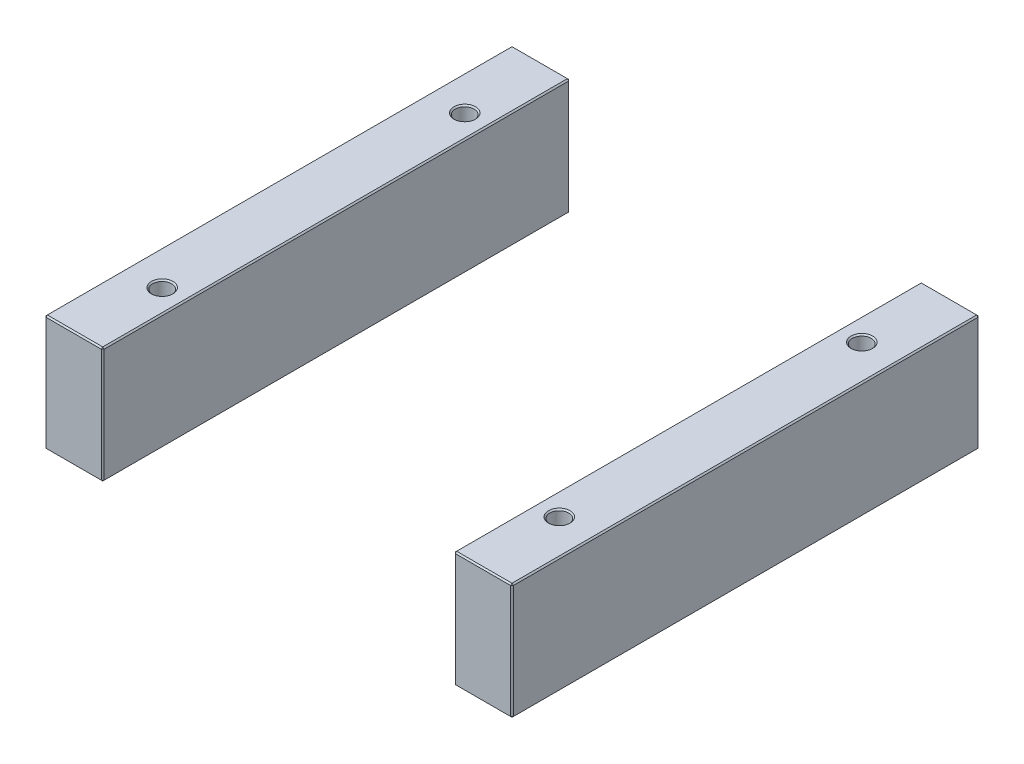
ISO-10303-21;
HEADER;
FILE_DESCRIPTION(('STEP AP214'),'2;1');
FILE_NAME('part.step','',(''),(''),'','','');
FILE_SCHEMA(('AUTOMOTIVE_DESIGN { 1 0 10303 214 1 1 1 1 }'));
ENDSEC;
DATA;
#1=APPLICATION_CONTEXT('core data for automotive mechanical design processes');
#2=APPLICATION_PROTOCOL_DEFINITION('international standard','automotive_design',2000,#1);
#3=PRODUCT_CONTEXT('',#1,'mechanical');
#4=PRODUCT('Part','Part','',(#3));
#5=PRODUCT_RELATED_PRODUCT_CATEGORY('part','',(#4));
#6=PRODUCT_DEFINITION_FORMATION('','',#4);
#7=PRODUCT_DEFINITION_CONTEXT('part definition',#1,'design');
#8=PRODUCT_DEFINITION('design','',#6,#7);
#9=PRODUCT_DEFINITION_SHAPE('','',#8);
#10=(LENGTH_UNIT() NAMED_UNIT(*) SI_UNIT(.MILLI.,.METRE.));
#11=(NAMED_UNIT(*) PLANE_ANGLE_UNIT() SI_UNIT($,.RADIAN.));
#12=(NAMED_UNIT(*) SI_UNIT($,.STERADIAN.) SOLID_ANGLE_UNIT());
#13=UNCERTAINTY_MEASURE_WITH_UNIT(LENGTH_MEASURE(1.E-05),#10,'distance_accuracy_value','');
#14=(GEOMETRIC_REPRESENTATION_CONTEXT(3) GLOBAL_UNCERTAINTY_ASSIGNED_CONTEXT((#13)) GLOBAL_UNIT_ASSIGNED_CONTEXT((#10,
#11,#12)) REPRESENTATION_CONTEXT('',''));
#15=CARTESIAN_POINT('',(0.,0.,0.));
#16=DIRECTION('',(0.,0.,1.));
#17=DIRECTION('',(1.,0.,0.));
#18=AXIS2_PLACEMENT_3D('',#15,#16,#17);
#19=CARTESIAN_POINT('',(-173.,86.,-173.));
#20=DIRECTION('',(0.,0.,1.));
#21=DIRECTION('',(1.,0.,0.));
#22=AXIS2_PLACEMENT_3D('',#19,#20,#21);
#23=PLANE('',#22);
#24=DIRECTION('',(-1.,0.,0.));
#25=VECTOR('',#24,1.);
#26=CARTESIAN_POINT('',(-173.,0.999999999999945,-173.));
#27=LINE('',#26,#25);
#28=CARTESIAN_POINT('',(-131.,0.999999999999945,-173.));
#29=VERTEX_POINT('',#28);
#30=CARTESIAN_POINT('',(-172.,0.999999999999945,-173.));
#31=VERTEX_POINT('',#30);
#32=EDGE_CURVE('P0_E137',#29,#31,#27,.T.);
#33=ORIENTED_EDGE('',*,*,#32,.T.);
#34=DIRECTION('',(0.,1.,0.));
#35=VECTOR('',#34,1.);
#36=CARTESIAN_POINT('',(-172.,86.,-173.));
#37=LINE('',#36,#35);
#38=CARTESIAN_POINT('',(-172.,85.,-173.));
#39=VERTEX_POINT('',#38);
#40=EDGE_CURVE('P0_E235',#31,#39,#37,.T.);
#41=ORIENTED_EDGE('',*,*,#40,.T.);
#42=DIRECTION('',(1.,0.,0.));
#43=VECTOR('',#42,1.);
#44=CARTESIAN_POINT('',(-173.,85.,-173.));
#45=LINE('',#44,#43);
#46=CARTESIAN_POINT('',(-131.,85.,-173.));
#47=VERTEX_POINT('',#46);
#48=EDGE_CURVE('P0_E233',#39,#47,#45,.T.);
#49=ORIENTED_EDGE('',*,*,#48,.T.);
#50=DIRECTION('',(0.,-1.,0.));
#51=VECTOR('',#50,1.);
#52=CARTESIAN_POINT('',(-131.,86.,-173.));
#53=LINE('',#52,#51);
#54=EDGE_CURVE('P0_E230',#47,#29,#53,.T.);
#55=ORIENTED_EDGE('',*,*,#54,.T.);
#56=EDGE_LOOP('',(#33,#41,#49,#55));
#57=FACE_BOUND('',#56,.T.);
#58=ADVANCED_FACE('P0_F16',(#57),#23,.F.);
#59=CARTESIAN_POINT('',(-173.,86.,173.));
#60=DIRECTION('',(1.,0.,0.));
#61=DIRECTION('',(0.,0.,-1.));
#62=AXIS2_PLACEMENT_3D('',#59,#60,#61);
#63=PLANE('',#62);
#64=DIRECTION('',(0.,1.,0.));
#65=VECTOR('',#64,1.);
#66=CARTESIAN_POINT('',(-173.,86.,172.));
#67=LINE('',#66,#65);
#68=CARTESIAN_POINT('',(-173.,0.999999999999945,172.));
#69=VERTEX_POINT('',#68);
#70=CARTESIAN_POINT('',(-173.,85.,172.));
#71=VERTEX_POINT('',#70);
#72=EDGE_CURVE('P0_E217',#69,#71,#67,.T.);
#73=ORIENTED_EDGE('',*,*,#72,.T.);
#74=DIRECTION('',(0.,0.,-1.));
#75=VECTOR('',#74,1.);
#76=CARTESIAN_POINT('',(-173.,85.,173.));
#77=LINE('',#76,#75);
#78=CARTESIAN_POINT('',(-173.,85.,-172.));
#79=VERTEX_POINT('',#78);
#80=EDGE_CURVE('P0_E228',#71,#79,#77,.T.);
#81=ORIENTED_EDGE('',*,*,#80,.T.);
#82=DIRECTION('',(0.,-1.,0.));
#83=VECTOR('',#82,1.);
#84=CARTESIAN_POINT('',(-173.,86.,-172.));
#85=LINE('',#84,#83);
#86=CARTESIAN_POINT('',(-173.,0.999999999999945,-172.));
#87=VERTEX_POINT('',#86);
#88=EDGE_CURVE('P0_E225',#79,#87,#85,.T.);
#89=ORIENTED_EDGE('',*,*,#88,.T.);
#90=DIRECTION('',(0.,0.,1.));
#91=VECTOR('',#90,1.);
#92=CARTESIAN_POINT('',(-173.,0.999999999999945,173.));
#93=LINE('',#92,#91);
#94=EDGE_CURVE('P0_E214',#87,#69,#93,.T.);
#95=ORIENTED_EDGE('',*,*,#94,.T.);
#96=EDGE_LOOP('',(#73,#81,#89,#95));
#97=FACE_BOUND('',#96,.T.);
#98=ADVANCED_FACE('P0_F302',(#97),#63,.F.);
#99=CARTESIAN_POINT('',(-173.,86.,173.));
#100=DIRECTION('',(0.,0.,-1.));
#101=DIRECTION('',(-1.,0.,0.));
#102=AXIS2_PLACEMENT_3D('',#99,#100,#101);
#103=PLANE('',#102);
#104=DIRECTION('',(-1.,0.,0.));
#105=VECTOR('',#104,1.);
#106=CARTESIAN_POINT('',(-173.,85.,173.));
#107=LINE('',#106,#105);
#108=CARTESIAN_POINT('',(-131.,85.,173.));
#109=VERTEX_POINT('',#108);
#110=CARTESIAN_POINT('',(-172.,85.,173.));
#111=VERTEX_POINT('',#110);
#112=EDGE_CURVE('P0_E242',#109,#111,#107,.T.);
#113=ORIENTED_EDGE('',*,*,#112,.T.);
#114=DIRECTION('',(0.,-1.,0.));
#115=VECTOR('',#114,1.);
#116=CARTESIAN_POINT('',(-172.,86.,173.));
#117=LINE('',#116,#115);
#118=CARTESIAN_POINT('',(-172.,0.999999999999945,173.));
#119=VERTEX_POINT('',#118);
#120=EDGE_CURVE('P0_E244',#111,#119,#117,.T.);
#121=ORIENTED_EDGE('',*,*,#120,.T.);
#122=DIRECTION('',(1.,0.,0.));
#123=VECTOR('',#122,1.);
#124=CARTESIAN_POINT('',(-130.,0.999999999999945,173.));
#125=LINE('',#124,#123);
#126=CARTESIAN_POINT('',(-131.,0.999999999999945,173.));
#127=VERTEX_POINT('',#126);
#128=EDGE_CURVE('P0_E240',#119,#127,#125,.T.);
#129=ORIENTED_EDGE('',*,*,#128,.T.);
#130=DIRECTION('',(0.,1.,0.));
#131=VECTOR('',#130,1.);
#132=CARTESIAN_POINT('',(-131.,86.,173.));
#133=LINE('',#132,#131);
#134=EDGE_CURVE('P0_E238',#127,#109,#133,.T.);
#135=ORIENTED_EDGE('',*,*,#134,.T.);
#136=EDGE_LOOP('',(#113,#121,#129,#135));
#137=FACE_BOUND('',#136,.T.);
#138=ADVANCED_FACE('P0_F341',(#137),#103,.F.);
#139=CARTESIAN_POINT('',(-130.,86.,-173.));
#140=DIRECTION('',(-1.,0.,0.));
#141=DIRECTION('',(0.,0.,1.));
#142=AXIS2_PLACEMENT_3D('',#139,#140,#141);
#143=PLANE('',#142);
#144=DIRECTION('',(0.,0.,1.));
#145=VECTOR('',#144,1.);
#146=CARTESIAN_POINT('',(-130.,85.,-173.));
#147=LINE('',#146,#145);
#148=CARTESIAN_POINT('',(-130.,85.,-172.));
#149=VERTEX_POINT('',#148);
#150=CARTESIAN_POINT('',(-130.,85.,172.));
#151=VERTEX_POINT('',#150);
#152=EDGE_CURVE('P0_E31',#149,#151,#147,.T.);
#153=ORIENTED_EDGE('',*,*,#152,.T.);
#154=DIRECTION('',(0.,-1.,0.));
#155=VECTOR('',#154,1.);
#156=CARTESIAN_POINT('',(-130.,86.,172.));
#157=LINE('',#156,#155);
#158=CARTESIAN_POINT('',(-130.,0.999999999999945,172.));
#159=VERTEX_POINT('',#158);
#160=EDGE_CURVE('P0_E190',#151,#159,#157,.T.);
#161=ORIENTED_EDGE('',*,*,#160,.T.);
#162=DIRECTION('',(0.,0.,-1.));
#163=VECTOR('',#162,1.);
#164=CARTESIAN_POINT('',(-130.,0.999999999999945,-173.));
#165=LINE('',#164,#163);
#166=CARTESIAN_POINT('',(-130.,0.999999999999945,-172.));
#167=VERTEX_POINT('',#166);
#168=EDGE_CURVE('P0_E256',#159,#167,#165,.T.);
#169=ORIENTED_EDGE('',*,*,#168,.T.);
#170=DIRECTION('',(0.,1.,0.));
#171=VECTOR('',#170,1.);
#172=CARTESIAN_POINT('',(-130.,86.,-172.));
#173=LINE('',#172,#171);
#174=EDGE_CURVE('P0_E36',#167,#149,#173,.T.);
#175=ORIENTED_EDGE('',*,*,#174,.T.);
#176=EDGE_LOOP('',(#153,#161,#169,#175));
#177=FACE_BOUND('',#176,.T.);
#178=ADVANCED_FACE('P0_F535',(#177),#143,.F.);
#179=CARTESIAN_POINT('',(0.,86.,0.));
#180=DIRECTION('',(0.,-1.,0.));
#181=DIRECTION('',(0.,0.,-1.));
#182=AXIS2_PLACEMENT_3D('',#179,#180,#181);
#183=PLANE('',#182);
#184=CARTESIAN_POINT('',(-147.,86.,112.));
#185=DIRECTION('',(0.,-1.,0.));
#186=DIRECTION('',(0.,0.,-1.));
#187=AXIS2_PLACEMENT_3D('',#184,#185,#186);
#188=CIRCLE('',#187,8.);
#189=CARTESIAN_POINT('',(-147.,86.,104.));
#190=VERTEX_POINT('',#189);
#191=EDGE_CURVE('P0_E24',#190,#190,#188,.T.);
#192=ORIENTED_EDGE('',*,*,#191,.T.);
#193=EDGE_LOOP('',(#192));
#194=FACE_BOUND('',#193,.T.);
#195=CARTESIAN_POINT('',(-147.,86.,-112.));
#196=DIRECTION('',(0.,-1.,0.));
#197=DIRECTION('',(0.,0.,-1.));
#198=AXIS2_PLACEMENT_3D('',#195,#196,#197);
#199=CIRCLE('',#198,8.);
#200=CARTESIAN_POINT('',(-147.,86.,-120.));
#201=VERTEX_POINT('',#200);
#202=EDGE_CURVE('P0_E189',#201,#201,#199,.T.);
#203=ORIENTED_EDGE('',*,*,#202,.T.);
#204=EDGE_LOOP('',(#203));
#205=FACE_BOUND('',#204,.T.);
#206=DIRECTION('',(0.,0.,1.));
#207=VECTOR('',#206,1.);
#208=CARTESIAN_POINT('',(-172.,86.,0.));
#209=LINE('',#208,#207);
#210=CARTESIAN_POINT('',(-172.,86.,-172.));
#211=VERTEX_POINT('',#210);
#212=CARTESIAN_POINT('',(-172.,86.,172.));
#213=VERTEX_POINT('',#212);
#214=EDGE_CURVE('P0_E251',#211,#213,#209,.T.);
#215=ORIENTED_EDGE('',*,*,#214,.T.);
#216=DIRECTION('',(1.,0.,0.));
#217=VECTOR('',#216,1.);
#218=CARTESIAN_POINT('',(1.11022302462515E-13,86.,172.));
#219=LINE('',#218,#217);
#220=CARTESIAN_POINT('',(-131.,86.,172.));
#221=VERTEX_POINT('',#220);
#222=EDGE_CURVE('P0_E253',#213,#221,#219,.T.);
#223=ORIENTED_EDGE('',*,*,#222,.T.);
#224=DIRECTION('',(0.,0.,-1.));
#225=VECTOR('',#224,1.);
#226=CARTESIAN_POINT('',(-131.,86.,0.));
#227=LINE('',#226,#225);
#228=CARTESIAN_POINT('',(-131.,86.,-172.));
#229=VERTEX_POINT('',#228);
#230=EDGE_CURVE('P0_E247',#221,#229,#227,.T.);
#231=ORIENTED_EDGE('',*,*,#230,.T.);
#232=DIRECTION('',(-1.,0.,0.));
#233=VECTOR('',#232,1.);
#234=CARTESIAN_POINT('',(-1.11022302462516E-13,86.,-172.));
#235=LINE('',#234,#233);
#236=EDGE_CURVE('P0_E249',#229,#211,#235,.T.);
#237=ORIENTED_EDGE('',*,*,#236,.T.);
#238=EDGE_LOOP('',(#215,#223,#231,#237));
#239=FACE_BOUND('',#238,.T.);
#240=ADVANCED_FACE('P0_F195',(#194,#205,#239),#183,.F.);
#241=CARTESIAN_POINT('',(0.,0.,0.));
#242=DIRECTION('',(0.,-1.,0.));
#243=DIRECTION('',(0.,0.,-1.));
#244=AXIS2_PLACEMENT_3D('',#241,#242,#243);
#245=PLANE('',#244);
#246=CARTESIAN_POINT('',(-147.,0.,-112.));
#247=DIRECTION('',(0.,-1.,0.));
#248=DIRECTION('',(0.,0.,-1.));
#249=AXIS2_PLACEMENT_3D('',#246,#247,#248);
#250=CIRCLE('',#249,8.);
#251=CARTESIAN_POINT('',(-147.,0.,-120.));
#252=VERTEX_POINT('',#251);
#253=EDGE_CURVE('P0_E220',#252,#252,#250,.F.);
#254=ORIENTED_EDGE('',*,*,#253,.T.);
#255=EDGE_LOOP('',(#254));
#256=FACE_BOUND('',#255,.T.);
#257=CARTESIAN_POINT('',(-147.,0.,112.));
#258=DIRECTION('',(0.,-1.,0.));
#259=DIRECTION('',(0.,0.,-1.));
#260=AXIS2_PLACEMENT_3D('',#257,#258,#259);
#261=CIRCLE('',#260,8.);
#262=CARTESIAN_POINT('',(-147.,0.,104.));
#263=VERTEX_POINT('',#262);
#264=EDGE_CURVE('P0_E608',#263,#263,#261,.F.);
#265=ORIENTED_EDGE('',*,*,#264,.T.);
#266=EDGE_LOOP('',(#265));
#267=FACE_BOUND('',#266,.T.);
#268=DIRECTION('',(-1.,0.,0.));
#269=VECTOR('',#268,1.);
#270=CARTESIAN_POINT('',(-173.,0.,172.));
#271=LINE('',#270,#269);
#272=CARTESIAN_POINT('',(-131.,0.,172.));
#273=VERTEX_POINT('',#272);
#274=CARTESIAN_POINT('',(-172.,0.,172.));
#275=VERTEX_POINT('',#274);
#276=EDGE_CURVE('P0_E114',#273,#275,#271,.T.);
#277=ORIENTED_EDGE('',*,*,#276,.T.);
#278=DIRECTION('',(0.,0.,-1.));
#279=VECTOR('',#278,1.);
#280=CARTESIAN_POINT('',(-172.,0.,-173.));
#281=LINE('',#280,#279);
#282=CARTESIAN_POINT('',(-172.,0.,-172.));
#283=VERTEX_POINT('',#282);
#284=EDGE_CURVE('P0_E110',#275,#283,#281,.T.);
#285=ORIENTED_EDGE('',*,*,#284,.T.);
#286=DIRECTION('',(1.,0.,0.));
#287=VECTOR('',#286,1.);
#288=CARTESIAN_POINT('',(-130.,0.,-172.));
#289=LINE('',#288,#287);
#290=CARTESIAN_POINT('',(-131.,0.,-172.));
#291=VERTEX_POINT('',#290);
#292=EDGE_CURVE('P0_E104',#283,#291,#289,.T.);
#293=ORIENTED_EDGE('',*,*,#292,.T.);
#294=DIRECTION('',(0.,0.,1.));
#295=VECTOR('',#294,1.);
#296=CARTESIAN_POINT('',(-131.,0.,173.));
#297=LINE('',#296,#295);
#298=EDGE_CURVE('P0_E107',#291,#273,#297,.T.);
#299=ORIENTED_EDGE('',*,*,#298,.T.);
#300=EDGE_LOOP('',(#277,#285,#293,#299));
#301=FACE_BOUND('',#300,.T.);
#302=ADVANCED_FACE('P0_F106',(#256,#267,#301),#245,.T.);
#303=CARTESIAN_POINT('',(-147.,0.,-112.));
#304=DIRECTION('',(0.,1.,0.));
#305=DIRECTION('',(0.,0.,1.));
#306=AXIS2_PLACEMENT_3D('',#303,#304,#305);
#307=CYLINDRICAL_SURFACE('',#306,7.);
#308=CARTESIAN_POINT('',(-147.,85.,-112.));
#309=DIRECTION('',(0.,-1.,0.));
#310=DIRECTION('',(0.,0.,-1.));
#311=AXIS2_PLACEMENT_3D('',#308,#309,#310);
#312=CIRCLE('',#311,7.);
#313=CARTESIAN_POINT('',(-147.,85.,-119.));
#314=VERTEX_POINT('',#313);
#315=EDGE_CURVE('P0_E10',#314,#314,#312,.F.);
#316=ORIENTED_EDGE('',*,*,#315,.T.);
#317=EDGE_LOOP('',(#316));
#318=FACE_BOUND('',#317,.T.);
#319=CARTESIAN_POINT('',(-147.,1.00000000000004,-112.));
#320=DIRECTION('',(0.,-1.,0.));
#321=DIRECTION('',(0.,0.,-1.));
#322=AXIS2_PLACEMENT_3D('',#319,#320,#321);
#323=CIRCLE('',#322,7.);
#324=CARTESIAN_POINT('',(-147.,1.00000000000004,-119.));
#325=VERTEX_POINT('',#324);
#326=EDGE_CURVE('P0_E215',#325,#325,#323,.T.);
#327=ORIENTED_EDGE('',*,*,#326,.T.);
#328=EDGE_LOOP('',(#327));
#329=FACE_BOUND('',#328,.T.);
#330=ADVANCED_FACE('P0_F208',(#318,#329),#307,.F.);
#331=CARTESIAN_POINT('',(-147.,0.,112.));
#332=DIRECTION('',(0.,1.,0.));
#333=DIRECTION('',(0.,0.,1.));
#334=AXIS2_PLACEMENT_3D('',#331,#332,#333);
#335=CYLINDRICAL_SURFACE('',#334,7.);
#336=CARTESIAN_POINT('',(-147.,85.,112.));
#337=DIRECTION('',(0.,-1.,0.));
#338=DIRECTION('',(0.,0.,-1.));
#339=AXIS2_PLACEMENT_3D('',#336,#337,#338);
#340=CIRCLE('',#339,7.);
#341=CARTESIAN_POINT('',(-147.,85.,105.));
#342=VERTEX_POINT('',#341);
#343=EDGE_CURVE('P0_E186',#342,#342,#340,.F.);
#344=ORIENTED_EDGE('',*,*,#343,.T.);
#345=EDGE_LOOP('',(#344));
#346=FACE_BOUND('',#345,.T.);
#347=CARTESIAN_POINT('',(-147.,1.00000000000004,112.));
#348=DIRECTION('',(0.,-1.,0.));
#349=DIRECTION('',(0.,0.,-1.));
#350=AXIS2_PLACEMENT_3D('',#347,#348,#349);
#351=CIRCLE('',#350,7.);
#352=CARTESIAN_POINT('',(-147.,1.00000000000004,105.));
#353=VERTEX_POINT('',#352);
#354=EDGE_CURVE('P0_E212',#353,#353,#351,.T.);
#355=ORIENTED_EDGE('',*,*,#354,.T.);
#356=EDGE_LOOP('',(#355));
#357=FACE_BOUND('',#356,.T.);
#358=ADVANCED_FACE('P0_F204',(#346,#357),#335,.F.);
#359=CARTESIAN_POINT('',(-147.,0.,-112.));
#360=DIRECTION('',(0.,-1.,0.));
#361=DIRECTION('',(0.,0.,-1.));
#362=AXIS2_PLACEMENT_3D('',#359,#360,#361);
#363=CONICAL_SURFACE('',#362,8.,0.78539816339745);
#364=ORIENTED_EDGE('',*,*,#326,.F.);
#365=EDGE_LOOP('',(#364));
#366=FACE_BOUND('',#365,.T.);
#367=ORIENTED_EDGE('',*,*,#253,.F.);
#368=EDGE_LOOP('',(#367));
#369=FACE_BOUND('',#368,.T.);
#370=ADVANCED_FACE('P0_F207',(#366,#369),#363,.F.);
#371=CARTESIAN_POINT('',(-147.,0.,112.));
#372=DIRECTION('',(0.,-1.,0.));
#373=DIRECTION('',(0.,0.,-1.));
#374=AXIS2_PLACEMENT_3D('',#371,#372,#373);
#375=CONICAL_SURFACE('',#374,8.,0.78539816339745);
#376=ORIENTED_EDGE('',*,*,#354,.F.);
#377=EDGE_LOOP('',(#376));
#378=FACE_BOUND('',#377,.T.);
#379=ORIENTED_EDGE('',*,*,#264,.F.);
#380=EDGE_LOOP('',(#379));
#381=FACE_BOUND('',#380,.T.);
#382=ADVANCED_FACE('P0_F347',(#378,#381),#375,.F.);
#383=CARTESIAN_POINT('',(-130.,86.,172.));
#384=DIRECTION('',(-0.707106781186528,0.,-0.707106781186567));
#385=DIRECTION('',(0.,-1.,0.));
#386=AXIS2_PLACEMENT_3D('',#383,#384,#385);
#387=PLANE('',#386);
#388=DIRECTION('',(-0.707106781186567,0.,0.707106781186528));
#389=VECTOR('',#388,1.);
#390=CARTESIAN_POINT('',(-130.5,85.,172.5));
#391=LINE('',#390,#389);
#392=EDGE_CURVE('P0_E125',#109,#151,#391,.F.);
#393=ORIENTED_EDGE('',*,*,#392,.F.);
#394=ORIENTED_EDGE('',*,*,#134,.F.);
#395=DIRECTION('',(0.707106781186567,0.,-0.707106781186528));
#396=VECTOR('',#395,1.);
#397=CARTESIAN_POINT('',(-131.,0.999999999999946,173.));
#398=LINE('',#397,#396);
#399=EDGE_CURVE('P0_E181',#159,#127,#398,.F.);
#400=ORIENTED_EDGE('',*,*,#399,.F.);
#401=ORIENTED_EDGE('',*,*,#160,.F.);
#402=EDGE_LOOP('',(#393,#394,#400,#401));
#403=FACE_BOUND('',#402,.T.);
#404=ADVANCED_FACE('P0_F351',(#403),#387,.F.);
#405=CARTESIAN_POINT('',(-131.,86.,172.));
#406=DIRECTION('',(0.577350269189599,0.577350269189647,0.577350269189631));
#407=DIRECTION('',(0.,-0.707106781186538,0.707106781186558));
#408=AXIS2_PLACEMENT_3D('',#405,#406,#407);
#409=PLANE('',#408);
#410=DIRECTION('',(0.,0.707106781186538,-0.707106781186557));
#411=VECTOR('',#410,1.);
#412=CARTESIAN_POINT('',(-131.,86.,172.));
#413=LINE('',#412,#411);
#414=EDGE_CURVE('P0_E175',#109,#221,#413,.T.);
#415=ORIENTED_EDGE('',*,*,#414,.F.);
#416=ORIENTED_EDGE('',*,*,#392,.T.);
#417=DIRECTION('',(0.707106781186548,-0.707106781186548,0.));
#418=VECTOR('',#417,1.);
#419=CARTESIAN_POINT('',(-131.,86.,172.));
#420=LINE('',#419,#418);
#421=EDGE_CURVE('P0_E178',#221,#151,#420,.T.);
#422=ORIENTED_EDGE('',*,*,#421,.F.);
#423=EDGE_LOOP('',(#415,#416,#422));
#424=FACE_BOUND('',#423,.T.);
#425=ADVANCED_FACE('P0_F487',(#424),#409,.T.);
#426=CARTESIAN_POINT('',(-131.,0.999999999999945,173.));
#427=DIRECTION('',(0.577350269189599,-0.577350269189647,0.577350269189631));
#428=DIRECTION('',(0.,-0.707106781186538,-0.707106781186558));
#429=AXIS2_PLACEMENT_3D('',#426,#427,#428);
#430=PLANE('',#429);
#431=DIRECTION('',(0.707106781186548,0.707106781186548,0.));
#432=VECTOR('',#431,1.);
#433=CARTESIAN_POINT('',(-130.5,0.500000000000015,172.));
#434=LINE('',#433,#432);
#435=EDGE_CURVE('P0_E123',#159,#273,#434,.F.);
#436=ORIENTED_EDGE('',*,*,#435,.F.);
#437=ORIENTED_EDGE('',*,*,#399,.T.);
#438=DIRECTION('',(0.,-0.707106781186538,-0.707106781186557));
#439=VECTOR('',#438,1.);
#440=CARTESIAN_POINT('',(-131.,0.999999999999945,173.));
#441=LINE('',#440,#439);
#442=EDGE_CURVE('P0_E172',#273,#127,#441,.F.);
#443=ORIENTED_EDGE('',*,*,#442,.F.);
#444=EDGE_LOOP('',(#436,#437,#443));
#445=FACE_BOUND('',#444,.T.);
#446=ADVANCED_FACE('P0_F478',(#445),#430,.T.);
#447=CARTESIAN_POINT('',(-131.,86.,0.));
#448=DIRECTION('',(-0.707106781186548,-0.707106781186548,0.));
#449=DIRECTION('',(0.,0.,-1.));
#450=AXIS2_PLACEMENT_3D('',#447,#448,#449);
#451=PLANE('',#450);
#452=ORIENTED_EDGE('',*,*,#421,.T.);
#453=ORIENTED_EDGE('',*,*,#152,.F.);
#454=DIRECTION('',(-0.707106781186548,0.707106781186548,0.));
#455=VECTOR('',#454,1.);
#456=CARTESIAN_POINT('',(-130.5,85.5,-172.));
#457=LINE('',#456,#455);
#458=EDGE_CURVE('P0_E165',#229,#149,#457,.F.);
#459=ORIENTED_EDGE('',*,*,#458,.F.);
#460=ORIENTED_EDGE('',*,*,#230,.F.);
#461=EDGE_LOOP('',(#452,#453,#459,#460));
#462=FACE_BOUND('',#461,.T.);
#463=ADVANCED_FACE('P0_F318',(#462),#451,.F.);
#464=CARTESIAN_POINT('',(1.11022302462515E-13,86.,172.));
#465=DIRECTION('',(0.,-0.707106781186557,-0.707106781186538));
#466=DIRECTION('',(1.,0.,0.));
#467=AXIS2_PLACEMENT_3D('',#464,#465,#466);
#468=PLANE('',#467);
#469=ORIENTED_EDGE('',*,*,#414,.T.);
#470=ORIENTED_EDGE('',*,*,#222,.F.);
#471=DIRECTION('',(0.,-0.707106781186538,0.707106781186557));
#472=VECTOR('',#471,1.);
#473=CARTESIAN_POINT('',(-172.,85.5,172.5));
#474=LINE('',#473,#472);
#475=EDGE_CURVE('P0_E162',#111,#213,#474,.F.);
#476=ORIENTED_EDGE('',*,*,#475,.F.);
#477=ORIENTED_EDGE('',*,*,#112,.F.);
#478=EDGE_LOOP('',(#469,#470,#476,#477));
#479=FACE_BOUND('',#478,.T.);
#480=ADVANCED_FACE('P0_F313',(#479),#468,.F.);
#481=CARTESIAN_POINT('',(-172.,86.,173.));
#482=DIRECTION('',(0.707106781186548,0.,-0.707106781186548));
#483=DIRECTION('',(0.,-1.,0.));
#484=AXIS2_PLACEMENT_3D('',#481,#482,#483);
#485=PLANE('',#484);
#486=DIRECTION('',(0.707106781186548,0.,0.707106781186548));
#487=VECTOR('',#486,1.);
#488=CARTESIAN_POINT('',(-172.,0.999999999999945,173.));
#489=LINE('',#488,#487);
#490=EDGE_CURVE('P0_E156',#119,#69,#489,.F.);
#491=ORIENTED_EDGE('',*,*,#490,.F.);
#492=ORIENTED_EDGE('',*,*,#120,.F.);
#493=DIRECTION('',(-0.707106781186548,0.,-0.707106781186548));
#494=VECTOR('',#493,1.);
#495=CARTESIAN_POINT('',(-173.,85.,172.));
#496=LINE('',#495,#494);
#497=EDGE_CURVE('P0_E159',#71,#111,#496,.F.);
#498=ORIENTED_EDGE('',*,*,#497,.F.);
#499=ORIENTED_EDGE('',*,*,#72,.F.);
#500=EDGE_LOOP('',(#491,#492,#498,#499));
#501=FACE_BOUND('',#500,.T.);
#502=ADVANCED_FACE('P0_F307',(#501),#485,.F.);
#503=CARTESIAN_POINT('',(-173.,0.999999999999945,173.));
#504=DIRECTION('',(0.,-0.707106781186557,0.707106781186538));
#505=DIRECTION('',(-1.,0.,0.));
#506=AXIS2_PLACEMENT_3D('',#503,#504,#505);
#507=PLANE('',#506);
#508=ORIENTED_EDGE('',*,*,#442,.T.);
#509=ORIENTED_EDGE('',*,*,#128,.F.);
#510=DIRECTION('',(0.,0.707106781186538,0.707106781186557));
#511=VECTOR('',#510,1.);
#512=CARTESIAN_POINT('',(-172.,0.999999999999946,173.));
#513=LINE('',#512,#511);
#514=EDGE_CURVE('P0_E134',#275,#119,#513,.T.);
#515=ORIENTED_EDGE('',*,*,#514,.F.);
#516=ORIENTED_EDGE('',*,*,#276,.F.);
#517=EDGE_LOOP('',(#508,#509,#515,#516));
#518=FACE_BOUND('',#517,.T.);
#519=ADVANCED_FACE('P0_F333',(#518),#507,.T.);
#520=CARTESIAN_POINT('',(-130.,0.999999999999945,-173.));
#521=DIRECTION('',(0.707106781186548,-0.707106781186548,0.));
#522=DIRECTION('',(0.,0.,1.));
#523=AXIS2_PLACEMENT_3D('',#520,#521,#522);
#524=PLANE('',#523);
#525=ORIENTED_EDGE('',*,*,#435,.T.);
#526=ORIENTED_EDGE('',*,*,#298,.F.);
#527=DIRECTION('',(-0.707106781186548,-0.707106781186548,0.));
#528=VECTOR('',#527,1.);
#529=CARTESIAN_POINT('',(-131.,0.,-172.));
#530=LINE('',#529,#528);
#531=EDGE_CURVE('P0_E120',#167,#291,#530,.T.);
#532=ORIENTED_EDGE('',*,*,#531,.F.);
#533=ORIENTED_EDGE('',*,*,#168,.F.);
#534=EDGE_LOOP('',(#525,#526,#532,#533));
#535=FACE_BOUND('',#534,.T.);
#536=ADVANCED_FACE('P0_F119',(#535),#524,.T.);
#537=CARTESIAN_POINT('',(-131.,86.,-173.));
#538=DIRECTION('',(-0.707106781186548,0.,0.707106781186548));
#539=DIRECTION('',(0.,-1.,0.));
#540=AXIS2_PLACEMENT_3D('',#537,#538,#539);
#541=PLANE('',#540);
#542=DIRECTION('',(0.707106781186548,0.,0.707106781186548));
#543=VECTOR('',#542,1.);
#544=CARTESIAN_POINT('',(-131.,85.,-173.));
#545=LINE('',#544,#543);
#546=EDGE_CURVE('P0_E168',#149,#47,#545,.F.);
#547=ORIENTED_EDGE('',*,*,#546,.F.);
#548=ORIENTED_EDGE('',*,*,#174,.F.);
#549=DIRECTION('',(-0.707106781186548,0.,-0.707106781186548));
#550=VECTOR('',#549,1.);
#551=CARTESIAN_POINT('',(-130.5,0.999999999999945,-172.5));
#552=LINE('',#551,#550);
#553=EDGE_CURVE('P0_E133',#29,#167,#552,.F.);
#554=ORIENTED_EDGE('',*,*,#553,.F.);
#555=ORIENTED_EDGE('',*,*,#54,.F.);
#556=EDGE_LOOP('',(#547,#548,#554,#555));
#557=FACE_BOUND('',#556,.T.);
#558=ADVANCED_FACE('P0_F323',(#557),#541,.F.);
#559=CARTESIAN_POINT('',(-131.,85.,-173.));
#560=DIRECTION('',(0.57735026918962,0.577350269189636,-0.57735026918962));
#561=DIRECTION('',(0.,0.707106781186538,0.707106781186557));
#562=AXIS2_PLACEMENT_3D('',#559,#560,#561);
#563=PLANE('',#562);
#564=ORIENTED_EDGE('',*,*,#458,.T.);
#565=ORIENTED_EDGE('',*,*,#546,.T.);
#566=DIRECTION('',(0.,-0.707106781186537,-0.707106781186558));
#567=VECTOR('',#566,1.);
#568=CARTESIAN_POINT('',(-131.,85.,-173.));
#569=LINE('',#568,#567);
#570=EDGE_CURVE('P0_E151',#229,#47,#569,.T.);
#571=ORIENTED_EDGE('',*,*,#570,.F.);
#572=EDGE_LOOP('',(#564,#565,#571));
#573=FACE_BOUND('',#572,.T.);
#574=ADVANCED_FACE('P0_F321',(#573),#563,.T.);
#575=CARTESIAN_POINT('',(-173.,85.,172.));
#576=DIRECTION('',(-0.57735026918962,0.577350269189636,0.57735026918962));
#577=DIRECTION('',(0.,-0.707106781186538,0.707106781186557));
#578=AXIS2_PLACEMENT_3D('',#575,#576,#577);
#579=PLANE('',#578);
#580=ORIENTED_EDGE('',*,*,#497,.T.);
#581=ORIENTED_EDGE('',*,*,#475,.T.);
#582=DIRECTION('',(0.707106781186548,0.707106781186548,0.));
#583=VECTOR('',#582,1.);
#584=CARTESIAN_POINT('',(-173.,85.,172.));
#585=LINE('',#584,#583);
#586=EDGE_CURVE('P0_E142',#71,#213,#585,.T.);
#587=ORIENTED_EDGE('',*,*,#586,.F.);
#588=EDGE_LOOP('',(#580,#581,#587));
#589=FACE_BOUND('',#588,.T.);
#590=ADVANCED_FACE('P0_F310',(#589),#579,.T.);
#591=CARTESIAN_POINT('',(-172.,0.999999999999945,173.));
#592=DIRECTION('',(-0.57735026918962,-0.577350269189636,0.57735026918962));
#593=DIRECTION('',(0.,-0.707106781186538,-0.707106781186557));
#594=AXIS2_PLACEMENT_3D('',#591,#592,#593);
#595=PLANE('',#594);
#596=ORIENTED_EDGE('',*,*,#514,.T.);
#597=ORIENTED_EDGE('',*,*,#490,.T.);
#598=DIRECTION('',(0.707106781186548,-0.707106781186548,0.));
#599=VECTOR('',#598,1.);
#600=CARTESIAN_POINT('',(-172.5,0.499999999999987,172.));
#601=LINE('',#600,#599);
#602=EDGE_CURVE('P0_E138',#275,#69,#601,.F.);
#603=ORIENTED_EDGE('',*,*,#602,.F.);
#604=EDGE_LOOP('',(#596,#597,#603));
#605=FACE_BOUND('',#604,.T.);
#606=ADVANCED_FACE('P0_F368',(#605),#595,.T.);
#607=CARTESIAN_POINT('',(-131.,0.,-172.));
#608=DIRECTION('',(0.57735026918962,-0.577350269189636,-0.57735026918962));
#609=DIRECTION('',(0.,0.707106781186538,-0.707106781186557));
#610=AXIS2_PLACEMENT_3D('',#607,#608,#609);
#611=PLANE('',#610);
#612=ORIENTED_EDGE('',*,*,#553,.T.);
#613=ORIENTED_EDGE('',*,*,#531,.T.);
#614=DIRECTION('',(0.,0.707106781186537,-0.707106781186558));
#615=VECTOR('',#614,1.);
#616=CARTESIAN_POINT('',(-131.,0.,-172.));
#617=LINE('',#616,#615);
#618=EDGE_CURVE('P0_E130',#29,#291,#617,.F.);
#619=ORIENTED_EDGE('',*,*,#618,.F.);
#620=EDGE_LOOP('',(#612,#613,#619));
#621=FACE_BOUND('',#620,.T.);
#622=ADVANCED_FACE('P0_F129',(#621),#611,.T.);
#623=CARTESIAN_POINT('',(-1.11022302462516E-13,86.,-172.));
#624=DIRECTION('',(0.,-0.707106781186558,0.707106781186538));
#625=DIRECTION('',(-1.,0.,0.));
#626=AXIS2_PLACEMENT_3D('',#623,#624,#625);
#627=PLANE('',#626);
#628=ORIENTED_EDGE('',*,*,#570,.T.);
#629=ORIENTED_EDGE('',*,*,#48,.F.);
#630=DIRECTION('',(0.,0.707106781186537,0.707106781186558));
#631=VECTOR('',#630,1.);
#632=CARTESIAN_POINT('',(-172.,85.,-173.));
#633=LINE('',#632,#631);
#634=EDGE_CURVE('P0_E139',#211,#39,#633,.F.);
#635=ORIENTED_EDGE('',*,*,#634,.F.);
#636=ORIENTED_EDGE('',*,*,#236,.F.);
#637=EDGE_LOOP('',(#628,#629,#635,#636));
#638=FACE_BOUND('',#637,.T.);
#639=ADVANCED_FACE('P0_F286',(#638),#627,.F.);
#640=CARTESIAN_POINT('',(-172.,86.,0.));
#641=DIRECTION('',(0.707106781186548,-0.707106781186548,0.));
#642=DIRECTION('',(0.,0.,1.));
#643=AXIS2_PLACEMENT_3D('',#640,#641,#642);
#644=PLANE('',#643);
#645=ORIENTED_EDGE('',*,*,#586,.T.);
#646=ORIENTED_EDGE('',*,*,#214,.F.);
#647=DIRECTION('',(-0.707106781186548,-0.707106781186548,0.));
#648=VECTOR('',#647,1.);
#649=CARTESIAN_POINT('',(-172.5,85.5,-172.));
#650=LINE('',#649,#648);
#651=EDGE_CURVE('P0_E145',#79,#211,#650,.F.);
#652=ORIENTED_EDGE('',*,*,#651,.F.);
#653=ORIENTED_EDGE('',*,*,#80,.F.);
#654=EDGE_LOOP('',(#645,#646,#652,#653));
#655=FACE_BOUND('',#654,.T.);
#656=ADVANCED_FACE('P0_F280',(#655),#644,.F.);
#657=CARTESIAN_POINT('',(-173.,0.999999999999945,173.));
#658=DIRECTION('',(-0.707106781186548,-0.707106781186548,0.));
#659=DIRECTION('',(0.,0.,-1.));
#660=AXIS2_PLACEMENT_3D('',#657,#658,#659);
#661=PLANE('',#660);
#662=ORIENTED_EDGE('',*,*,#602,.T.);
#663=ORIENTED_EDGE('',*,*,#94,.F.);
#664=DIRECTION('',(-0.707106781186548,0.707106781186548,0.));
#665=VECTOR('',#664,1.);
#666=CARTESIAN_POINT('',(-173.,0.999999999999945,-172.));
#667=LINE('',#666,#665);
#668=EDGE_CURVE('P0_E267',#283,#87,#667,.T.);
#669=ORIENTED_EDGE('',*,*,#668,.F.);
#670=ORIENTED_EDGE('',*,*,#284,.F.);
#671=EDGE_LOOP('',(#662,#663,#669,#670));
#672=FACE_BOUND('',#671,.T.);
#673=ADVANCED_FACE('P0_F298',(#672),#661,.T.);
#674=CARTESIAN_POINT('',(-173.,0.999999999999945,-173.));
#675=DIRECTION('',(0.,-0.707106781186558,-0.707106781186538));
#676=DIRECTION('',(1.,0.,0.));
#677=AXIS2_PLACEMENT_3D('',#674,#675,#676);
#678=PLANE('',#677);
#679=ORIENTED_EDGE('',*,*,#618,.T.);
#680=ORIENTED_EDGE('',*,*,#292,.F.);
#681=DIRECTION('',(0.,-0.707106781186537,0.707106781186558));
#682=VECTOR('',#681,1.);
#683=CARTESIAN_POINT('',(-172.,0.499999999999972,-172.5));
#684=LINE('',#683,#682);
#685=EDGE_CURVE('P0_E265',#31,#283,#684,.T.);
#686=ORIENTED_EDGE('',*,*,#685,.F.);
#687=ORIENTED_EDGE('',*,*,#32,.F.);
#688=EDGE_LOOP('',(#679,#680,#686,#687));
#689=FACE_BOUND('',#688,.T.);
#690=ADVANCED_FACE('P0_F136',(#689),#678,.T.);
#691=CARTESIAN_POINT('',(-172.,85.,-173.));
#692=DIRECTION('',(-0.57735026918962,0.577350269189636,-0.57735026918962));
#693=DIRECTION('',(0.,0.707106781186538,0.707106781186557));
#694=AXIS2_PLACEMENT_3D('',#691,#692,#693);
#695=PLANE('',#694);
#696=ORIENTED_EDGE('',*,*,#651,.T.);
#697=ORIENTED_EDGE('',*,*,#634,.T.);
#698=DIRECTION('',(0.707106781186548,0.,-0.707106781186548));
#699=VECTOR('',#698,1.);
#700=CARTESIAN_POINT('',(-172.,85.,-173.));
#701=LINE('',#700,#699);
#702=EDGE_CURVE('P0_E263',#79,#39,#701,.T.);
#703=ORIENTED_EDGE('',*,*,#702,.F.);
#704=EDGE_LOOP('',(#696,#697,#703));
#705=FACE_BOUND('',#704,.T.);
#706=ADVANCED_FACE('P0_F273',(#705),#695,.T.);
#707=CARTESIAN_POINT('',(-173.,0.999999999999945,-172.));
#708=DIRECTION('',(-0.57735026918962,-0.577350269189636,-0.57735026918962));
#709=DIRECTION('',(0.,0.707106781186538,-0.707106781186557));
#710=AXIS2_PLACEMENT_3D('',#707,#708,#709);
#711=PLANE('',#710);
#712=ORIENTED_EDGE('',*,*,#685,.T.);
#713=ORIENTED_EDGE('',*,*,#668,.T.);
#714=DIRECTION('',(-0.707106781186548,0.,0.707106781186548));
#715=VECTOR('',#714,1.);
#716=CARTESIAN_POINT('',(-173.,0.999999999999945,-172.));
#717=LINE('',#716,#715);
#718=EDGE_CURVE('P0_E261',#31,#87,#717,.T.);
#719=ORIENTED_EDGE('',*,*,#718,.F.);
#720=EDGE_LOOP('',(#712,#713,#719));
#721=FACE_BOUND('',#720,.T.);
#722=ADVANCED_FACE('P0_F294',(#721),#711,.T.);
#723=CARTESIAN_POINT('',(-173.,86.,-172.));
#724=DIRECTION('',(0.707106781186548,0.,0.707106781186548));
#725=DIRECTION('',(0.,-1.,0.));
#726=AXIS2_PLACEMENT_3D('',#723,#724,#725);
#727=PLANE('',#726);
#728=ORIENTED_EDGE('',*,*,#702,.T.);
#729=ORIENTED_EDGE('',*,*,#40,.F.);
#730=ORIENTED_EDGE('',*,*,#718,.T.);
#731=ORIENTED_EDGE('',*,*,#88,.F.);
#732=EDGE_LOOP('',(#728,#729,#730,#731));
#733=FACE_BOUND('',#732,.T.);
#734=ADVANCED_FACE('P0_F201',(#733),#727,.F.);
#735=CARTESIAN_POINT('',(-147.,85.,112.));
#736=DIRECTION('',(0.,1.,0.));
#737=DIRECTION('',(0.,0.,1.));
#738=AXIS2_PLACEMENT_3D('',#735,#736,#737);
#739=CONICAL_SURFACE('',#738,7.,0.785398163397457);
#740=ORIENTED_EDGE('',*,*,#191,.F.);
#741=EDGE_LOOP('',(#740));
#742=FACE_BOUND('',#741,.T.);
#743=ORIENTED_EDGE('',*,*,#343,.F.);
#744=EDGE_LOOP('',(#743));
#745=FACE_BOUND('',#744,.T.);
#746=ADVANCED_FACE('P0_F198',(#742,#745),#739,.F.);
#747=CARTESIAN_POINT('',(-147.,85.,-112.));
#748=DIRECTION('',(0.,1.,0.));
#749=DIRECTION('',(0.,0.,1.));
#750=AXIS2_PLACEMENT_3D('',#747,#748,#749);
#751=CONICAL_SURFACE('',#750,7.,0.785398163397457);
#752=ORIENTED_EDGE('',*,*,#202,.F.);
#753=EDGE_LOOP('',(#752));
#754=FACE_BOUND('',#753,.T.);
#755=ORIENTED_EDGE('',*,*,#315,.F.);
#756=EDGE_LOOP('',(#755));
#757=FACE_BOUND('',#756,.T.);
#758=ADVANCED_FACE('P0_F18',(#754,#757),#751,.F.);
#759=CLOSED_SHELL('',(#58,#98,#138,#178,#240,#302,#330,#358,#370,#382,#404,#425,#446,#463,#480,
#502,#519,#536,#558,#574,#590,#606,#622,#639,#656,#673,#690,#706,#722,#734,#746,#758));
#760=MANIFOLD_SOLID_BREP('P0_B1',#759);
#761=CARTESIAN_POINT('',(173.,86.,173.));
#762=DIRECTION('',(0.,0.,-1.));
#763=DIRECTION('',(-1.,0.,0.));
#764=AXIS2_PLACEMENT_3D('',#761,#762,#763);
#765=PLANE('',#764);
#766=DIRECTION('',(0.,-1.,0.));
#767=VECTOR('',#766,1.);
#768=CARTESIAN_POINT('',(131.,86.,173.));
#769=LINE('',#768,#767);
#770=CARTESIAN_POINT('',(131.,85.,173.));
#771=VERTEX_POINT('',#770);
#772=CARTESIAN_POINT('',(131.,1.,173.));
#773=VERTEX_POINT('',#772);
#774=EDGE_CURVE('P1_E174',#771,#773,#769,.T.);
#775=ORIENTED_EDGE('',*,*,#774,.T.);
#776=DIRECTION('',(1.,0.,0.));
#777=VECTOR('',#776,1.);
#778=CARTESIAN_POINT('',(173.,1.,173.));
#779=LINE('',#778,#777);
#780=CARTESIAN_POINT('',(172.,1.,173.));
#781=VERTEX_POINT('',#780);
#782=EDGE_CURVE('P1_E176',#773,#781,#779,.T.);
#783=ORIENTED_EDGE('',*,*,#782,.T.);
#784=DIRECTION('',(0.,1.,0.));
#785=VECTOR('',#784,1.);
#786=CARTESIAN_POINT('',(172.,86.,173.));
#787=LINE('',#786,#785);
#788=CARTESIAN_POINT('',(172.,85.,173.));
#789=VERTEX_POINT('',#788);
#790=EDGE_CURVE('P1_E172',#781,#789,#787,.T.);
#791=ORIENTED_EDGE('',*,*,#790,.T.);
#792=DIRECTION('',(-1.,0.,0.));
#793=VECTOR('',#792,1.);
#794=CARTESIAN_POINT('',(130.,85.,173.));
#795=LINE('',#794,#793);
#796=EDGE_CURVE('P1_E170',#789,#771,#795,.T.);
#797=ORIENTED_EDGE('',*,*,#796,.T.);
#798=EDGE_LOOP('',(#775,#783,#791,#797));
#799=FACE_BOUND('',#798,.T.);
#800=ADVANCED_FACE('P1_F17',(#799),#765,.F.);
#801=CARTESIAN_POINT('',(173.,86.,173.));
#802=DIRECTION('',(-1.,0.,0.));
#803=DIRECTION('',(0.,0.,1.));
#804=AXIS2_PLACEMENT_3D('',#801,#802,#803);
#805=PLANE('',#804);
#806=DIRECTION('',(0.,0.,1.));
#807=VECTOR('',#806,1.);
#808=CARTESIAN_POINT('',(173.,85.,173.));
#809=LINE('',#808,#807);
#810=CARTESIAN_POINT('',(173.,85.,-172.));
#811=VERTEX_POINT('',#810);
#812=CARTESIAN_POINT('',(173.,85.,172.));
#813=VERTEX_POINT('',#812);
#814=EDGE_CURVE('P1_E188',#811,#813,#809,.T.);
#815=ORIENTED_EDGE('',*,*,#814,.T.);
#816=DIRECTION('',(0.,-1.,0.));
#817=VECTOR('',#816,1.);
#818=CARTESIAN_POINT('',(173.,86.,172.));
#819=LINE('',#818,#817);
#820=CARTESIAN_POINT('',(173.,1.,172.));
#821=VERTEX_POINT('',#820);
#822=EDGE_CURVE('P1_E194',#813,#821,#819,.T.);
#823=ORIENTED_EDGE('',*,*,#822,.T.);
#824=DIRECTION('',(0.,0.,-1.));
#825=VECTOR('',#824,1.);
#826=CARTESIAN_POINT('',(173.,1.,173.));
#827=LINE('',#826,#825);
#828=CARTESIAN_POINT('',(173.,1.,-172.));
#829=VERTEX_POINT('',#828);
#830=EDGE_CURVE('P1_E192',#821,#829,#827,.T.);
#831=ORIENTED_EDGE('',*,*,#830,.T.);
#832=DIRECTION('',(0.,1.,0.));
#833=VECTOR('',#832,1.);
#834=CARTESIAN_POINT('',(173.,86.,-172.));
#835=LINE('',#834,#833);
#836=EDGE_CURVE('P1_E190',#829,#811,#835,.T.);
#837=ORIENTED_EDGE('',*,*,#836,.T.);
#838=EDGE_LOOP('',(#815,#823,#831,#837));
#839=FACE_BOUND('',#838,.T.);
#840=ADVANCED_FACE('P1_F276',(#839),#805,.F.);
#841=CARTESIAN_POINT('',(173.,86.,-173.));
#842=DIRECTION('',(0.,0.,1.));
#843=DIRECTION('',(1.,0.,0.));
#844=AXIS2_PLACEMENT_3D('',#841,#842,#843);
#845=PLANE('',#844);
#846=DIRECTION('',(0.,-1.,0.));
#847=VECTOR('',#846,1.);
#848=CARTESIAN_POINT('',(172.,86.,-173.));
#849=LINE('',#848,#847);
#850=CARTESIAN_POINT('',(172.,85.,-173.));
#851=VERTEX_POINT('',#850);
#852=CARTESIAN_POINT('',(172.,1.,-173.));
#853=VERTEX_POINT('',#852);
#854=EDGE_CURVE('P1_E165',#851,#853,#849,.T.);
#855=ORIENTED_EDGE('',*,*,#854,.T.);
#856=DIRECTION('',(-1.,0.,0.));
#857=VECTOR('',#856,1.);
#858=CARTESIAN_POINT('',(173.,1.,-173.));
#859=LINE('',#858,#857);
#860=CARTESIAN_POINT('',(131.,1.,-173.));
#861=VERTEX_POINT('',#860);
#862=EDGE_CURVE('P1_E113',#853,#861,#859,.T.);
#863=ORIENTED_EDGE('',*,*,#862,.T.);
#864=DIRECTION('',(0.,1.,0.));
#865=VECTOR('',#864,1.);
#866=CARTESIAN_POINT('',(131.,86.,-173.));
#867=LINE('',#866,#865);
#868=CARTESIAN_POINT('',(131.,85.,-173.));
#869=VERTEX_POINT('',#868);
#870=EDGE_CURVE('P1_E167',#861,#869,#867,.T.);
#871=ORIENTED_EDGE('',*,*,#870,.T.);
#872=DIRECTION('',(1.,0.,0.));
#873=VECTOR('',#872,1.);
#874=CARTESIAN_POINT('',(173.,85.,-173.));
#875=LINE('',#874,#873);
#876=EDGE_CURVE('P1_E163',#869,#851,#875,.T.);
#877=ORIENTED_EDGE('',*,*,#876,.T.);
#878=EDGE_LOOP('',(#855,#863,#871,#877));
#879=FACE_BOUND('',#878,.T.);
#880=ADVANCED_FACE('P1_F333',(#879),#845,.F.);
#881=CARTESIAN_POINT('',(130.,86.,-173.));
#882=DIRECTION('',(1.,0.,0.));
#883=DIRECTION('',(0.,0.,-1.));
#884=AXIS2_PLACEMENT_3D('',#881,#882,#883);
#885=PLANE('',#884);
#886=DIRECTION('',(0.,0.,-1.));
#887=VECTOR('',#886,1.);
#888=CARTESIAN_POINT('',(130.,85.,-173.));
#889=LINE('',#888,#887);
#890=CARTESIAN_POINT('',(130.,85.,172.));
#891=VERTEX_POINT('',#890);
#892=CARTESIAN_POINT('',(130.,85.,-172.));
#893=VERTEX_POINT('',#892);
#894=EDGE_CURVE('P1_E179',#891,#893,#889,.T.);
#895=ORIENTED_EDGE('',*,*,#894,.T.);
#896=DIRECTION('',(0.,-1.,0.));
#897=VECTOR('',#896,1.);
#898=CARTESIAN_POINT('',(130.,86.,-172.));
#899=LINE('',#898,#897);
#900=CARTESIAN_POINT('',(130.,1.,-172.));
#901=VERTEX_POINT('',#900);
#902=EDGE_CURVE('P1_E185',#893,#901,#899,.T.);
#903=ORIENTED_EDGE('',*,*,#902,.T.);
#904=DIRECTION('',(0.,0.,1.));
#905=VECTOR('',#904,1.);
#906=CARTESIAN_POINT('',(130.,1.,-173.));
#907=LINE('',#906,#905);
#908=CARTESIAN_POINT('',(130.,1.,172.));
#909=VERTEX_POINT('',#908);
#910=EDGE_CURVE('P1_E183',#901,#909,#907,.T.);
#911=ORIENTED_EDGE('',*,*,#910,.T.);
#912=DIRECTION('',(0.,1.,0.));
#913=VECTOR('',#912,1.);
#914=CARTESIAN_POINT('',(130.,86.,172.));
#915=LINE('',#914,#913);
#916=EDGE_CURVE('P1_E181',#909,#891,#915,.T.);
#917=ORIENTED_EDGE('',*,*,#916,.T.);
#918=EDGE_LOOP('',(#895,#903,#911,#917));
#919=FACE_BOUND('',#918,.T.);
#920=ADVANCED_FACE('P1_F544',(#919),#885,.F.);
#921=CARTESIAN_POINT('',(0.,86.,0.));
#922=DIRECTION('',(0.,1.,0.));
#923=DIRECTION('',(0.,0.,1.));
#924=AXIS2_PLACEMENT_3D('',#921,#922,#923);
#925=PLANE('',#924);
#926=DIRECTION('',(-1.,0.,0.));
#927=VECTOR('',#926,1.);
#928=CARTESIAN_POINT('',(130.,86.,-172.));
#929=LINE('',#928,#927);
#930=CARTESIAN_POINT('',(172.,86.,-172.));
#931=VERTEX_POINT('',#930);
#932=CARTESIAN_POINT('',(131.,86.,-172.));
#933=VERTEX_POINT('',#932);
#934=EDGE_CURVE('P1_E26',#931,#933,#929,.T.);
#935=ORIENTED_EDGE('',*,*,#934,.T.);
#936=DIRECTION('',(0.,0.,1.));
#937=VECTOR('',#936,1.);
#938=CARTESIAN_POINT('',(131.,86.,173.));
#939=LINE('',#938,#937);
#940=CARTESIAN_POINT('',(131.,86.,172.));
#941=VERTEX_POINT('',#940);
#942=EDGE_CURVE('P1_E11',#933,#941,#939,.T.);
#943=ORIENTED_EDGE('',*,*,#942,.T.);
#944=DIRECTION('',(1.,0.,0.));
#945=VECTOR('',#944,1.);
#946=CARTESIAN_POINT('',(173.,86.,172.));
#947=LINE('',#946,#945);
#948=CARTESIAN_POINT('',(172.,86.,172.));
#949=VERTEX_POINT('',#948);
#950=EDGE_CURVE('P1_E203',#941,#949,#947,.T.);
#951=ORIENTED_EDGE('',*,*,#950,.T.);
#952=DIRECTION('',(0.,0.,-1.));
#953=VECTOR('',#952,1.);
#954=CARTESIAN_POINT('',(172.,86.,-173.));
#955=LINE('',#954,#953);
#956=EDGE_CURVE('P1_E37',#949,#931,#955,.T.);
#957=ORIENTED_EDGE('',*,*,#956,.T.);
#958=EDGE_LOOP('',(#935,#943,#951,#957));
#959=FACE_BOUND('',#958,.T.);
#960=CARTESIAN_POINT('',(147.,86.,-112.));
#961=DIRECTION('',(0.,1.,0.));
#962=DIRECTION('',(0.,0.,1.));
#963=AXIS2_PLACEMENT_3D('',#960,#961,#962);
#964=CIRCLE('',#963,8.);
#965=CARTESIAN_POINT('',(147.,86.,-104.));
#966=VERTEX_POINT('',#965);
#967=EDGE_CURVE('P1_E200',#966,#966,#964,.F.);
#968=ORIENTED_EDGE('',*,*,#967,.T.);
#969=EDGE_LOOP('',(#968));
#970=FACE_BOUND('',#969,.T.);
#971=CARTESIAN_POINT('',(147.,86.,112.));
#972=DIRECTION('',(0.,1.,0.));
#973=DIRECTION('',(0.,0.,1.));
#974=AXIS2_PLACEMENT_3D('',#971,#972,#973);
#975=CIRCLE('',#974,8.);
#976=CARTESIAN_POINT('',(147.,86.,120.));
#977=VERTEX_POINT('',#976);
#978=EDGE_CURVE('P1_E197',#977,#977,#975,.F.);
#979=ORIENTED_EDGE('',*,*,#978,.T.);
#980=EDGE_LOOP('',(#979));
#981=FACE_BOUND('',#980,.T.);
#982=ADVANCED_FACE('P1_F299',(#959,#970,#981),#925,.T.);
#983=CARTESIAN_POINT('',(0.,0.,0.));
#984=DIRECTION('',(0.,1.,0.));
#985=DIRECTION('',(0.,0.,1.));
#986=AXIS2_PLACEMENT_3D('',#983,#984,#985);
#987=PLANE('',#986);
#988=CARTESIAN_POINT('',(147.,0.,-112.));
#989=DIRECTION('',(0.,1.,0.));
#990=DIRECTION('',(0.,0.,1.));
#991=AXIS2_PLACEMENT_3D('',#988,#989,#990);
#992=CIRCLE('',#991,8.);
#993=CARTESIAN_POINT('',(147.,0.,-104.));
#994=VERTEX_POINT('',#993);
#995=EDGE_CURVE('P1_E148',#994,#994,#992,.T.);
#996=ORIENTED_EDGE('',*,*,#995,.T.);
#997=EDGE_LOOP('',(#996));
#998=FACE_BOUND('',#997,.T.);
#999=CARTESIAN_POINT('',(147.,0.,112.));
#1000=DIRECTION('',(0.,1.,0.));
#1001=DIRECTION('',(0.,0.,1.));
#1002=AXIS2_PLACEMENT_3D('',#999,#1000,#1001);
#1003=CIRCLE('',#1002,8.);
#1004=CARTESIAN_POINT('',(147.,0.,120.));
#1005=VERTEX_POINT('',#1004);
#1006=EDGE_CURVE('P1_E142',#1005,#1005,#1003,.T.);
#1007=ORIENTED_EDGE('',*,*,#1006,.T.);
#1008=EDGE_LOOP('',(#1007));
#1009=FACE_BOUND('',#1008,.T.);
#1010=DIRECTION('',(-1.,0.,0.));
#1011=VECTOR('',#1010,1.);
#1012=CARTESIAN_POINT('',(0.,0.,172.));
#1013=LINE('',#1012,#1011);
#1014=CARTESIAN_POINT('',(172.,0.,172.));
#1015=VERTEX_POINT('',#1014);
#1016=CARTESIAN_POINT('',(131.,0.,172.));
#1017=VERTEX_POINT('',#1016);
#1018=EDGE_CURVE('P1_E135',#1015,#1017,#1013,.T.);
#1019=ORIENTED_EDGE('',*,*,#1018,.T.);
#1020=DIRECTION('',(0.,0.,-1.));
#1021=VECTOR('',#1020,1.);
#1022=CARTESIAN_POINT('',(131.,0.,0.));
#1023=LINE('',#1022,#1021);
#1024=CARTESIAN_POINT('',(131.,0.,-172.));
#1025=VERTEX_POINT('',#1024);
#1026=EDGE_CURVE('P1_E139',#1017,#1025,#1023,.T.);
#1027=ORIENTED_EDGE('',*,*,#1026,.T.);
#1028=DIRECTION('',(1.,0.,0.));
#1029=VECTOR('',#1028,1.);
#1030=CARTESIAN_POINT('',(-1.11022302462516E-13,0.,-172.));
#1031=LINE('',#1030,#1029);
#1032=CARTESIAN_POINT('',(172.,0.,-172.));
#1033=VERTEX_POINT('',#1032);
#1034=EDGE_CURVE('P1_E110',#1025,#1033,#1031,.T.);
#1035=ORIENTED_EDGE('',*,*,#1034,.T.);
#1036=DIRECTION('',(0.,0.,1.));
#1037=VECTOR('',#1036,1.);
#1038=CARTESIAN_POINT('',(172.,0.,0.));
#1039=LINE('',#1038,#1037);
#1040=EDGE_CURVE('P1_E129',#1033,#1015,#1039,.T.);
#1041=ORIENTED_EDGE('',*,*,#1040,.T.);
#1042=EDGE_LOOP('',(#1019,#1027,#1035,#1041));
#1043=FACE_BOUND('',#1042,.T.);
#1044=ADVANCED_FACE('P1_F137',(#998,#1009,#1043),#987,.F.);
#1045=CARTESIAN_POINT('',(147.,0.,-112.));
#1046=DIRECTION('',(0.,1.,0.));
#1047=DIRECTION('',(0.,0.,1.));
#1048=AXIS2_PLACEMENT_3D('',#1045,#1046,#1047);
#1049=CYLINDRICAL_SURFACE('',#1048,7.);
#1050=CARTESIAN_POINT('',(147.,1.00000000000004,-112.));
#1051=DIRECTION('',(0.,1.,0.));
#1052=DIRECTION('',(0.,0.,1.));
#1053=AXIS2_PLACEMENT_3D('',#1050,#1051,#1052);
#1054=CIRCLE('',#1053,7.);
#1055=CARTESIAN_POINT('',(147.,1.00000000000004,-105.));
#1056=VERTEX_POINT('',#1055);
#1057=EDGE_CURVE('P1_E154',#1056,#1056,#1054,.F.);
#1058=ORIENTED_EDGE('',*,*,#1057,.T.);
#1059=EDGE_LOOP('',(#1058));
#1060=FACE_BOUND('',#1059,.T.);
#1061=CARTESIAN_POINT('',(147.,85.,-112.));
#1062=DIRECTION('',(0.,1.,0.));
#1063=DIRECTION('',(0.,0.,1.));
#1064=AXIS2_PLACEMENT_3D('',#1061,#1062,#1063);
#1065=CIRCLE('',#1064,7.);
#1066=CARTESIAN_POINT('',(147.,85.,-105.));
#1067=VERTEX_POINT('',#1066);
#1068=EDGE_CURVE('P1_E151',#1067,#1067,#1065,.T.);
#1069=ORIENTED_EDGE('',*,*,#1068,.T.);
#1070=EDGE_LOOP('',(#1069));
#1071=FACE_BOUND('',#1070,.T.);
#1072=ADVANCED_FACE('P1_F515',(#1060,#1071),#1049,.F.);
#1073=CARTESIAN_POINT('',(147.,0.,112.));
#1074=DIRECTION('',(0.,1.,0.));
#1075=DIRECTION('',(0.,0.,1.));
#1076=AXIS2_PLACEMENT_3D('',#1073,#1074,#1075);
#1077=CYLINDRICAL_SURFACE('',#1076,7.);
#1078=CARTESIAN_POINT('',(147.,1.00000000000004,112.));
#1079=DIRECTION('',(0.,1.,0.));
#1080=DIRECTION('',(0.,0.,1.));
#1081=AXIS2_PLACEMENT_3D('',#1078,#1079,#1080);
#1082=CIRCLE('',#1081,7.);
#1083=CARTESIAN_POINT('',(147.,1.00000000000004,119.));
#1084=VERTEX_POINT('',#1083);
#1085=EDGE_CURVE('P1_E160',#1084,#1084,#1082,.F.);
#1086=ORIENTED_EDGE('',*,*,#1085,.T.);
#1087=EDGE_LOOP('',(#1086));
#1088=FACE_BOUND('',#1087,.T.);
#1089=CARTESIAN_POINT('',(147.,85.,112.));
#1090=DIRECTION('',(0.,1.,0.));
#1091=DIRECTION('',(0.,0.,1.));
#1092=AXIS2_PLACEMENT_3D('',#1089,#1090,#1091);
#1093=CIRCLE('',#1092,7.);
#1094=CARTESIAN_POINT('',(147.,85.,119.));
#1095=VERTEX_POINT('',#1094);
#1096=EDGE_CURVE('P1_E157',#1095,#1095,#1093,.T.);
#1097=ORIENTED_EDGE('',*,*,#1096,.T.);
#1098=EDGE_LOOP('',(#1097));
#1099=FACE_BOUND('',#1098,.T.);
#1100=ADVANCED_FACE('P1_F341',(#1088,#1099),#1077,.F.);
#1101=CARTESIAN_POINT('',(147.,0.,-112.));
#1102=DIRECTION('',(0.,-1.,0.));
#1103=DIRECTION('',(0.,0.,-1.));
#1104=AXIS2_PLACEMENT_3D('',#1101,#1102,#1103);
#1105=CONICAL_SURFACE('',#1104,8.,0.78539816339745);
#1106=ORIENTED_EDGE('',*,*,#1057,.F.);
#1107=EDGE_LOOP('',(#1106));
#1108=FACE_BOUND('',#1107,.T.);
#1109=ORIENTED_EDGE('',*,*,#995,.F.);
#1110=EDGE_LOOP('',(#1109));
#1111=FACE_BOUND('',#1110,.T.);
#1112=ADVANCED_FACE('P1_F337',(#1108,#1111),#1105,.F.);
#1113=CARTESIAN_POINT('',(147.,0.,112.));
#1114=DIRECTION('',(0.,-1.,0.));
#1115=DIRECTION('',(0.,0.,-1.));
#1116=AXIS2_PLACEMENT_3D('',#1113,#1114,#1115);
#1117=CONICAL_SURFACE('',#1116,8.,0.78539816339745);
#1118=ORIENTED_EDGE('',*,*,#1085,.F.);
#1119=EDGE_LOOP('',(#1118));
#1120=FACE_BOUND('',#1119,.T.);
#1121=ORIENTED_EDGE('',*,*,#1006,.F.);
#1122=EDGE_LOOP('',(#1121));
#1123=FACE_BOUND('',#1122,.T.);
#1124=ADVANCED_FACE('P1_F340',(#1120,#1123),#1117,.F.);
#1125=CARTESIAN_POINT('',(0.,86.,172.));
#1126=DIRECTION('',(0.,0.707106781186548,0.707106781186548));
#1127=DIRECTION('',(-1.,0.,0.));
#1128=AXIS2_PLACEMENT_3D('',#1125,#1126,#1127);
#1129=PLANE('',#1128);
#1130=DIRECTION('',(0.,-0.707106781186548,0.707106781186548));
#1131=VECTOR('',#1130,1.);
#1132=CARTESIAN_POINT('',(172.,85.,173.));
#1133=LINE('',#1132,#1131);
#1134=EDGE_CURVE('P1_E21',#949,#789,#1133,.T.);
#1135=ORIENTED_EDGE('',*,*,#1134,.F.);
#1136=ORIENTED_EDGE('',*,*,#950,.F.);
#1137=DIRECTION('',(0.,0.707106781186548,-0.707106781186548));
#1138=VECTOR('',#1137,1.);
#1139=CARTESIAN_POINT('',(131.,85.5,172.5));
#1140=LINE('',#1139,#1138);
#1141=EDGE_CURVE('P1_E255',#771,#941,#1140,.T.);
#1142=ORIENTED_EDGE('',*,*,#1141,.F.);
#1143=ORIENTED_EDGE('',*,*,#796,.F.);
#1144=EDGE_LOOP('',(#1135,#1136,#1142,#1143));
#1145=FACE_BOUND('',#1144,.T.);
#1146=ADVANCED_FACE('P1_F301',(#1145),#1129,.T.);
#1147=CARTESIAN_POINT('',(172.,85.,173.));
#1148=DIRECTION('',(0.577350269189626,0.577350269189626,0.577350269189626));
#1149=DIRECTION('',(0.707106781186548,0.,-0.707106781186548));
#1150=AXIS2_PLACEMENT_3D('',#1147,#1148,#1149);
#1151=PLANE('',#1150);
#1152=DIRECTION('',(-0.707106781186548,0.707106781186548,0.));
#1153=VECTOR('',#1152,1.);
#1154=CARTESIAN_POINT('',(172.5,85.5,172.));
#1155=LINE('',#1154,#1153);
#1156=EDGE_CURVE('P1_E250',#949,#813,#1155,.F.);
#1157=ORIENTED_EDGE('',*,*,#1156,.F.);
#1158=ORIENTED_EDGE('',*,*,#1134,.T.);
#1159=DIRECTION('',(-0.707106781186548,0.,0.707106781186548));
#1160=VECTOR('',#1159,1.);
#1161=CARTESIAN_POINT('',(172.,85.,173.));
#1162=LINE('',#1161,#1160);
#1163=EDGE_CURVE('P1_E253',#813,#789,#1162,.T.);
#1164=ORIENTED_EDGE('',*,*,#1163,.F.);
#1165=EDGE_LOOP('',(#1157,#1158,#1164));
#1166=FACE_BOUND('',#1165,.T.);
#1167=ADVANCED_FACE('P1_F267',(#1166),#1151,.T.);
#1168=CARTESIAN_POINT('',(130.,85.,172.));
#1169=DIRECTION('',(-0.577350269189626,0.577350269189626,0.577350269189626));
#1170=DIRECTION('',(0.707106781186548,0.,0.707106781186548));
#1171=AXIS2_PLACEMENT_3D('',#1168,#1169,#1170);
#1172=PLANE('',#1171);
#1173=DIRECTION('',(-0.707106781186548,0.,-0.707106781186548));
#1174=VECTOR('',#1173,1.);
#1175=CARTESIAN_POINT('',(130.,85.,172.));
#1176=LINE('',#1175,#1174);
#1177=EDGE_CURVE('P1_E245',#771,#891,#1176,.T.);
#1178=ORIENTED_EDGE('',*,*,#1177,.F.);
#1179=ORIENTED_EDGE('',*,*,#1141,.T.);
#1180=DIRECTION('',(-0.707106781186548,-0.707106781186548,0.));
#1181=VECTOR('',#1180,1.);
#1182=CARTESIAN_POINT('',(130.,85.,172.));
#1183=LINE('',#1182,#1181);
#1184=EDGE_CURVE('P1_E248',#891,#941,#1183,.F.);
#1185=ORIENTED_EDGE('',*,*,#1184,.F.);
#1186=EDGE_LOOP('',(#1178,#1179,#1185));
#1187=FACE_BOUND('',#1186,.T.);
#1188=ADVANCED_FACE('P1_F303',(#1187),#1172,.T.);
#1189=CARTESIAN_POINT('',(173.,86.,172.));
#1190=DIRECTION('',(-0.707106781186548,0.,-0.707106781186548));
#1191=DIRECTION('',(0.,-1.,0.));
#1192=AXIS2_PLACEMENT_3D('',#1189,#1190,#1191);
#1193=PLANE('',#1192);
#1194=ORIENTED_EDGE('',*,*,#1163,.T.);
#1195=ORIENTED_EDGE('',*,*,#790,.F.);
#1196=DIRECTION('',(0.707106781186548,0.,-0.707106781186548));
#1197=VECTOR('',#1196,1.);
#1198=CARTESIAN_POINT('',(172.,1.,173.));
#1199=LINE('',#1198,#1197);
#1200=EDGE_CURVE('P1_E240',#821,#781,#1199,.F.);
#1201=ORIENTED_EDGE('',*,*,#1200,.F.);
#1202=ORIENTED_EDGE('',*,*,#822,.F.);
#1203=EDGE_LOOP('',(#1194,#1195,#1201,#1202));
#1204=FACE_BOUND('',#1203,.T.);
#1205=ADVANCED_FACE('P1_F273',(#1204),#1193,.F.);
#1206=CARTESIAN_POINT('',(172.,86.,0.));
#1207=DIRECTION('',(0.707106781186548,0.707106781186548,0.));
#1208=DIRECTION('',(0.,0.,1.));
#1209=AXIS2_PLACEMENT_3D('',#1206,#1207,#1208);
#1210=PLANE('',#1209);
#1211=ORIENTED_EDGE('',*,*,#1156,.T.);
#1212=ORIENTED_EDGE('',*,*,#814,.F.);
#1213=DIRECTION('',(0.707106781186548,-0.707106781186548,0.));
#1214=VECTOR('',#1213,1.);
#1215=CARTESIAN_POINT('',(173.,85.,-172.));
#1216=LINE('',#1215,#1214);
#1217=EDGE_CURVE('P1_E237',#931,#811,#1216,.T.);
#1218=ORIENTED_EDGE('',*,*,#1217,.F.);
#1219=ORIENTED_EDGE('',*,*,#956,.F.);
#1220=EDGE_LOOP('',(#1211,#1212,#1218,#1219));
#1221=FACE_BOUND('',#1220,.T.);
#1222=ADVANCED_FACE('P1_F281',(#1221),#1210,.T.);
#1223=CARTESIAN_POINT('',(-1.11022302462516E-13,86.,-172.));
#1224=DIRECTION('',(0.,0.707106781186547,-0.707106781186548));
#1225=DIRECTION('',(1.,0.,0.));
#1226=AXIS2_PLACEMENT_3D('',#1223,#1224,#1225);
#1227=PLANE('',#1226);
#1228=DIRECTION('',(0.,-0.707106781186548,-0.707106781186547));
#1229=VECTOR('',#1228,1.);
#1230=CARTESIAN_POINT('',(131.,85.,-173.));
#1231=LINE('',#1230,#1229);
#1232=EDGE_CURVE('P1_E231',#933,#869,#1231,.T.);
#1233=ORIENTED_EDGE('',*,*,#1232,.F.);
#1234=ORIENTED_EDGE('',*,*,#934,.F.);
#1235=DIRECTION('',(0.,0.707106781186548,0.707106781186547));
#1236=VECTOR('',#1235,1.);
#1237=CARTESIAN_POINT('',(172.,85.5,-172.5));
#1238=LINE('',#1237,#1236);
#1239=EDGE_CURVE('P1_E234',#851,#931,#1238,.T.);
#1240=ORIENTED_EDGE('',*,*,#1239,.F.);
#1241=ORIENTED_EDGE('',*,*,#876,.F.);
#1242=EDGE_LOOP('',(#1233,#1234,#1240,#1241));
#1243=FACE_BOUND('',#1242,.T.);
#1244=ADVANCED_FACE('P1_F290',(#1243),#1227,.T.);
#1245=CARTESIAN_POINT('',(131.,86.,0.));
#1246=DIRECTION('',(-0.707106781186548,0.707106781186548,0.));
#1247=DIRECTION('',(0.,0.,-1.));
#1248=AXIS2_PLACEMENT_3D('',#1245,#1246,#1247);
#1249=PLANE('',#1248);
#1250=ORIENTED_EDGE('',*,*,#1184,.T.);
#1251=ORIENTED_EDGE('',*,*,#942,.F.);
#1252=DIRECTION('',(0.707106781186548,0.707106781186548,0.));
#1253=VECTOR('',#1252,1.);
#1254=CARTESIAN_POINT('',(130.5,85.5,-172.));
#1255=LINE('',#1254,#1253);
#1256=EDGE_CURVE('P1_E228',#893,#933,#1255,.T.);
#1257=ORIENTED_EDGE('',*,*,#1256,.F.);
#1258=ORIENTED_EDGE('',*,*,#894,.F.);
#1259=EDGE_LOOP('',(#1250,#1251,#1257,#1258));
#1260=FACE_BOUND('',#1259,.T.);
#1261=ADVANCED_FACE('P1_F298',(#1260),#1249,.T.);
#1262=CARTESIAN_POINT('',(131.,86.,173.));
#1263=DIRECTION('',(0.707106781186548,0.,-0.707106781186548));
#1264=DIRECTION('',(0.,-1.,0.));
#1265=AXIS2_PLACEMENT_3D('',#1262,#1263,#1264);
#1266=PLANE('',#1265);
#1267=ORIENTED_EDGE('',*,*,#1177,.T.);
#1268=ORIENTED_EDGE('',*,*,#916,.F.);
#1269=DIRECTION('',(0.707106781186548,0.,0.707106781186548));
#1270=VECTOR('',#1269,1.);
#1271=CARTESIAN_POINT('',(130.5,1.,172.5));
#1272=LINE('',#1271,#1270);
#1273=EDGE_CURVE('P1_E225',#773,#909,#1272,.F.);
#1274=ORIENTED_EDGE('',*,*,#1273,.F.);
#1275=ORIENTED_EDGE('',*,*,#774,.F.);
#1276=EDGE_LOOP('',(#1267,#1268,#1274,#1275));
#1277=FACE_BOUND('',#1276,.T.);
#1278=ADVANCED_FACE('P1_F307',(#1277),#1266,.F.);
#1279=CARTESIAN_POINT('',(173.,1.,173.));
#1280=DIRECTION('',(0.,0.707106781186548,-0.707106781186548));
#1281=DIRECTION('',(1.,0.,0.));
#1282=AXIS2_PLACEMENT_3D('',#1279,#1280,#1281);
#1283=PLANE('',#1282);
#1284=DIRECTION('',(0.,0.707106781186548,0.707106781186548));
#1285=VECTOR('',#1284,1.);
#1286=CARTESIAN_POINT('',(172.,1.,173.));
#1287=LINE('',#1286,#1285);
#1288=EDGE_CURVE('P1_E242',#781,#1015,#1287,.F.);
#1289=ORIENTED_EDGE('',*,*,#1288,.F.);
#1290=ORIENTED_EDGE('',*,*,#782,.F.);
#1291=DIRECTION('',(0.,-0.707106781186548,-0.707106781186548));
#1292=VECTOR('',#1291,1.);
#1293=CARTESIAN_POINT('',(131.,0.,172.));
#1294=LINE('',#1293,#1292);
#1295=EDGE_CURVE('P1_E222',#1017,#773,#1294,.F.);
#1296=ORIENTED_EDGE('',*,*,#1295,.F.);
#1297=ORIENTED_EDGE('',*,*,#1018,.F.);
#1298=EDGE_LOOP('',(#1289,#1290,#1296,#1297));
#1299=FACE_BOUND('',#1298,.T.);
#1300=ADVANCED_FACE('P1_F313',(#1299),#1283,.F.);
#1301=CARTESIAN_POINT('',(172.,1.,173.));
#1302=DIRECTION('',(0.577350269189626,-0.577350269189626,0.577350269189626));
#1303=DIRECTION('',(0.707106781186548,0.,-0.707106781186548));
#1304=AXIS2_PLACEMENT_3D('',#1301,#1302,#1303);
#1305=PLANE('',#1304);
#1306=ORIENTED_EDGE('',*,*,#1200,.T.);
#1307=ORIENTED_EDGE('',*,*,#1288,.T.);
#1308=DIRECTION('',(-0.707106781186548,-0.707106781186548,0.));
#1309=VECTOR('',#1308,1.);
#1310=CARTESIAN_POINT('',(172.5,0.5,172.));
#1311=LINE('',#1310,#1309);
#1312=EDGE_CURVE('P1_E132',#821,#1015,#1311,.T.);
#1313=ORIENTED_EDGE('',*,*,#1312,.F.);
#1314=EDGE_LOOP('',(#1306,#1307,#1313));
#1315=FACE_BOUND('',#1314,.T.);
#1316=ADVANCED_FACE('P1_F316',(#1315),#1305,.T.);
#1317=CARTESIAN_POINT('',(173.,85.,-172.));
#1318=DIRECTION('',(0.577350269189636,0.57735026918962,-0.57735026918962));
#1319=DIRECTION('',(-0.707106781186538,0.,-0.707106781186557));
#1320=AXIS2_PLACEMENT_3D('',#1317,#1318,#1319);
#1321=PLANE('',#1320);
#1322=ORIENTED_EDGE('',*,*,#1239,.T.);
#1323=ORIENTED_EDGE('',*,*,#1217,.T.);
#1324=DIRECTION('',(0.707106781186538,0.,0.707106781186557));
#1325=VECTOR('',#1324,1.);
#1326=CARTESIAN_POINT('',(173.,85.,-172.));
#1327=LINE('',#1326,#1325);
#1328=EDGE_CURVE('P1_E218',#851,#811,#1327,.T.);
#1329=ORIENTED_EDGE('',*,*,#1328,.F.);
#1330=EDGE_LOOP('',(#1322,#1323,#1329));
#1331=FACE_BOUND('',#1330,.T.);
#1332=ADVANCED_FACE('P1_F285',(#1331),#1321,.T.);
#1333=CARTESIAN_POINT('',(131.,85.,-173.));
#1334=DIRECTION('',(-0.577350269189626,0.577350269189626,-0.577350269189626));
#1335=DIRECTION('',(-0.707106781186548,0.,0.707106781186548));
#1336=AXIS2_PLACEMENT_3D('',#1333,#1334,#1335);
#1337=PLANE('',#1336);
#1338=ORIENTED_EDGE('',*,*,#1256,.T.);
#1339=ORIENTED_EDGE('',*,*,#1232,.T.);
#1340=DIRECTION('',(0.707106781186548,0.,-0.707106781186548));
#1341=VECTOR('',#1340,1.);
#1342=CARTESIAN_POINT('',(131.,85.,-173.));
#1343=LINE('',#1342,#1341);
#1344=EDGE_CURVE('P1_E215',#893,#869,#1343,.T.);
#1345=ORIENTED_EDGE('',*,*,#1344,.F.);
#1346=EDGE_LOOP('',(#1338,#1339,#1345));
#1347=FACE_BOUND('',#1346,.T.);
#1348=ADVANCED_FACE('P1_F294',(#1347),#1337,.T.);
#1349=CARTESIAN_POINT('',(131.,0.,172.));
#1350=DIRECTION('',(-0.577350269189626,-0.577350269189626,0.577350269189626));
#1351=DIRECTION('',(0.707106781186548,0.,0.707106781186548));
#1352=AXIS2_PLACEMENT_3D('',#1349,#1350,#1351);
#1353=PLANE('',#1352);
#1354=ORIENTED_EDGE('',*,*,#1295,.T.);
#1355=ORIENTED_EDGE('',*,*,#1273,.T.);
#1356=DIRECTION('',(-0.707106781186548,0.707106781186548,0.));
#1357=VECTOR('',#1356,1.);
#1358=CARTESIAN_POINT('',(131.,0.,172.));
#1359=LINE('',#1358,#1357);
#1360=EDGE_CURVE('P1_E126',#1017,#909,#1359,.T.);
#1361=ORIENTED_EDGE('',*,*,#1360,.F.);
#1362=EDGE_LOOP('',(#1354,#1355,#1361));
#1363=FACE_BOUND('',#1362,.T.);
#1364=ADVANCED_FACE('P1_F369',(#1363),#1353,.T.);
#1365=CARTESIAN_POINT('',(173.,1.,173.));
#1366=DIRECTION('',(-0.707106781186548,0.707106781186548,0.));
#1367=DIRECTION('',(0.,0.,-1.));
#1368=AXIS2_PLACEMENT_3D('',#1365,#1366,#1367);
#1369=PLANE('',#1368);
#1370=ORIENTED_EDGE('',*,*,#1312,.T.);
#1371=ORIENTED_EDGE('',*,*,#1040,.F.);
#1372=DIRECTION('',(0.707106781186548,0.707106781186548,0.));
#1373=VECTOR('',#1372,1.);
#1374=CARTESIAN_POINT('',(172.,0.,-172.));
#1375=LINE('',#1374,#1373);
#1376=EDGE_CURVE('P1_E120',#829,#1033,#1375,.F.);
#1377=ORIENTED_EDGE('',*,*,#1376,.F.);
#1378=ORIENTED_EDGE('',*,*,#830,.F.);
#1379=EDGE_LOOP('',(#1370,#1371,#1377,#1378));
#1380=FACE_BOUND('',#1379,.T.);
#1381=ADVANCED_FACE('P1_F130',(#1380),#1369,.F.);
#1382=CARTESIAN_POINT('',(172.,86.,-173.));
#1383=DIRECTION('',(-0.707106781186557,0.,0.707106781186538));
#1384=DIRECTION('',(0.,-1.,0.));
#1385=AXIS2_PLACEMENT_3D('',#1382,#1383,#1384);
#1386=PLANE('',#1385);
#1387=ORIENTED_EDGE('',*,*,#1328,.T.);
#1388=ORIENTED_EDGE('',*,*,#836,.F.);
#1389=DIRECTION('',(-0.707106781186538,0.,-0.707106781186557));
#1390=VECTOR('',#1389,1.);
#1391=CARTESIAN_POINT('',(172.5,1.,-172.5));
#1392=LINE('',#1391,#1390);
#1393=EDGE_CURVE('P1_E124',#853,#829,#1392,.F.);
#1394=ORIENTED_EDGE('',*,*,#1393,.F.);
#1395=ORIENTED_EDGE('',*,*,#854,.F.);
#1396=EDGE_LOOP('',(#1387,#1388,#1394,#1395));
#1397=FACE_BOUND('',#1396,.T.);
#1398=ADVANCED_FACE('P1_F362',(#1397),#1386,.F.);
#1399=CARTESIAN_POINT('',(130.,86.,-172.));
#1400=DIRECTION('',(0.707106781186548,0.,0.707106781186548));
#1401=DIRECTION('',(0.,-1.,0.));
#1402=AXIS2_PLACEMENT_3D('',#1399,#1400,#1401);
#1403=PLANE('',#1402);
#1404=ORIENTED_EDGE('',*,*,#1344,.T.);
#1405=ORIENTED_EDGE('',*,*,#870,.F.);
#1406=DIRECTION('',(-0.707106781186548,0.,0.707106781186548));
#1407=VECTOR('',#1406,1.);
#1408=CARTESIAN_POINT('',(131.,1.,-173.));
#1409=LINE('',#1408,#1407);
#1410=EDGE_CURVE('P1_E209',#901,#861,#1409,.F.);
#1411=ORIENTED_EDGE('',*,*,#1410,.F.);
#1412=ORIENTED_EDGE('',*,*,#902,.F.);
#1413=EDGE_LOOP('',(#1404,#1405,#1411,#1412));
#1414=FACE_BOUND('',#1413,.T.);
#1415=ADVANCED_FACE('P1_F358',(#1414),#1403,.F.);
#1416=CARTESIAN_POINT('',(130.,1.,-173.));
#1417=DIRECTION('',(0.707106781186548,0.707106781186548,0.));
#1418=DIRECTION('',(0.,0.,1.));
#1419=AXIS2_PLACEMENT_3D('',#1416,#1417,#1418);
#1420=PLANE('',#1419);
#1421=ORIENTED_EDGE('',*,*,#1360,.T.);
#1422=ORIENTED_EDGE('',*,*,#910,.F.);
#1423=DIRECTION('',(0.707106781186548,-0.707106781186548,0.));
#1424=VECTOR('',#1423,1.);
#1425=CARTESIAN_POINT('',(130.5,0.5,-172.));
#1426=LINE('',#1425,#1424);
#1427=EDGE_CURVE('P1_E116',#1025,#901,#1426,.F.);
#1428=ORIENTED_EDGE('',*,*,#1427,.F.);
#1429=ORIENTED_EDGE('',*,*,#1026,.F.);
#1430=EDGE_LOOP('',(#1421,#1422,#1428,#1429));
#1431=FACE_BOUND('',#1430,.T.);
#1432=ADVANCED_FACE('P1_F355',(#1431),#1420,.F.);
#1433=CARTESIAN_POINT('',(172.,0.,-172.));
#1434=DIRECTION('',(0.577350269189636,-0.57735026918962,-0.57735026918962));
#1435=DIRECTION('',(-0.707106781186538,0.,-0.707106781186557));
#1436=AXIS2_PLACEMENT_3D('',#1433,#1434,#1435);
#1437=PLANE('',#1436);
#1438=ORIENTED_EDGE('',*,*,#1393,.T.);
#1439=ORIENTED_EDGE('',*,*,#1376,.T.);
#1440=DIRECTION('',(0.,-0.707106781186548,0.707106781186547));
#1441=VECTOR('',#1440,1.);
#1442=CARTESIAN_POINT('',(172.,0.,-172.));
#1443=LINE('',#1442,#1441);
#1444=EDGE_CURVE('P1_E106',#853,#1033,#1443,.T.);
#1445=ORIENTED_EDGE('',*,*,#1444,.F.);
#1446=EDGE_LOOP('',(#1438,#1439,#1445));
#1447=FACE_BOUND('',#1446,.T.);
#1448=ADVANCED_FACE('P1_F122',(#1447),#1437,.T.);
#1449=CARTESIAN_POINT('',(131.,1.,-173.));
#1450=DIRECTION('',(-0.577350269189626,-0.577350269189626,-0.577350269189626));
#1451=DIRECTION('',(-0.707106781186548,0.,0.707106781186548));
#1452=AXIS2_PLACEMENT_3D('',#1449,#1450,#1451);
#1453=PLANE('',#1452);
#1454=ORIENTED_EDGE('',*,*,#1427,.T.);
#1455=ORIENTED_EDGE('',*,*,#1410,.T.);
#1456=DIRECTION('',(0.,0.707106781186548,-0.707106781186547));
#1457=VECTOR('',#1456,1.);
#1458=CARTESIAN_POINT('',(131.,1.,-173.));
#1459=LINE('',#1458,#1457);
#1460=EDGE_CURVE('P1_E117',#1025,#861,#1459,.T.);
#1461=ORIENTED_EDGE('',*,*,#1460,.F.);
#1462=EDGE_LOOP('',(#1454,#1455,#1461));
#1463=FACE_BOUND('',#1462,.T.);
#1464=ADVANCED_FACE('P1_F349',(#1463),#1453,.T.);
#1465=CARTESIAN_POINT('',(173.,1.,-173.));
#1466=DIRECTION('',(0.,0.707106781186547,0.707106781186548));
#1467=DIRECTION('',(-1.,0.,0.));
#1468=AXIS2_PLACEMENT_3D('',#1465,#1466,#1467);
#1469=PLANE('',#1468);
#1470=ORIENTED_EDGE('',*,*,#1444,.T.);
#1471=ORIENTED_EDGE('',*,*,#1034,.F.);
#1472=ORIENTED_EDGE('',*,*,#1460,.T.);
#1473=ORIENTED_EDGE('',*,*,#862,.F.);
#1474=EDGE_LOOP('',(#1470,#1471,#1472,#1473));
#1475=FACE_BOUND('',#1474,.T.);
#1476=ADVANCED_FACE('P1_F108',(#1475),#1469,.F.);
#1477=CARTESIAN_POINT('',(147.,85.,-112.));
#1478=DIRECTION('',(0.,1.,0.));
#1479=DIRECTION('',(0.,0.,1.));
#1480=AXIS2_PLACEMENT_3D('',#1477,#1478,#1479);
#1481=CONICAL_SURFACE('',#1480,7.,0.785398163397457);
#1482=ORIENTED_EDGE('',*,*,#967,.F.);
#1483=EDGE_LOOP('',(#1482));
#1484=FACE_BOUND('',#1483,.T.);
#1485=ORIENTED_EDGE('',*,*,#1068,.F.);
#1486=EDGE_LOOP('',(#1485));
#1487=FACE_BOUND('',#1486,.T.);
#1488=ADVANCED_FACE('P1_F348',(#1484,#1487),#1481,.F.);
#1489=CARTESIAN_POINT('',(147.,85.,112.));
#1490=DIRECTION('',(0.,1.,0.));
#1491=DIRECTION('',(0.,0.,1.));
#1492=AXIS2_PLACEMENT_3D('',#1489,#1490,#1491);
#1493=CONICAL_SURFACE('',#1492,7.,0.785398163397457);
#1494=ORIENTED_EDGE('',*,*,#978,.F.);
#1495=EDGE_LOOP('',(#1494));
#1496=FACE_BOUND('',#1495,.T.);
#1497=ORIENTED_EDGE('',*,*,#1096,.F.);
#1498=EDGE_LOOP('',(#1497));
#1499=FACE_BOUND('',#1498,.T.);
#1500=ADVANCED_FACE('P1_F19',(#1496,#1499),#1493,.F.);
#1501=CLOSED_SHELL('',(#800,#840,#880,#920,#982,#1044,#1072,#1100,#1112,#1124,#1146,#1167,#1188,
#1205,#1222,#1244,#1261,#1278,#1300,#1316,#1332,#1348,#1364,#1381,#1398,#1415,#1432,#1448,#1464,
#1476,#1488,#1500));
#1502=MANIFOLD_SOLID_BREP('P1_B1',#1501);
#1503=ADVANCED_BREP_SHAPE_REPRESENTATION('',(#18,#760,#1502),#14);
#1504=SHAPE_DEFINITION_REPRESENTATION(#9,#1503);
ENDSEC;
END-ISO-10303-21;
